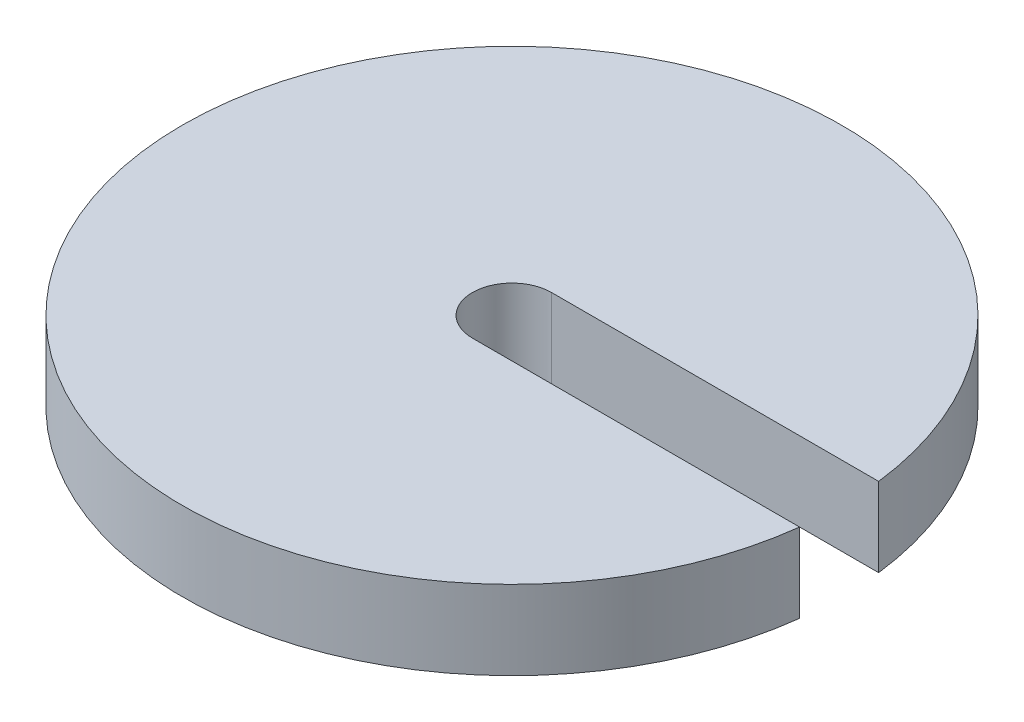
ISO-10303-21;
HEADER;
FILE_DESCRIPTION(('STEP AP214'),'2;1');
FILE_NAME('part.step','',(''),(''),'','','');
FILE_SCHEMA(('AUTOMOTIVE_DESIGN { 1 0 10303 214 1 1 1 1 }'));
ENDSEC;
DATA;
#1=APPLICATION_CONTEXT('core data for automotive mechanical design processes');
#2=APPLICATION_PROTOCOL_DEFINITION('international standard','automotive_design',2000,#1);
#3=PRODUCT_CONTEXT('',#1,'mechanical');
#4=PRODUCT('Part','Part','',(#3));
#5=PRODUCT_RELATED_PRODUCT_CATEGORY('part','',(#4));
#6=PRODUCT_DEFINITION_FORMATION('','',#4);
#7=PRODUCT_DEFINITION_CONTEXT('part definition',#1,'design');
#8=PRODUCT_DEFINITION('design','',#6,#7);
#9=PRODUCT_DEFINITION_SHAPE('','',#8);
#10=(LENGTH_UNIT() NAMED_UNIT(*) SI_UNIT(.MILLI.,.METRE.));
#11=(NAMED_UNIT(*) PLANE_ANGLE_UNIT() SI_UNIT($,.RADIAN.));
#12=(NAMED_UNIT(*) SI_UNIT($,.STERADIAN.) SOLID_ANGLE_UNIT());
#13=UNCERTAINTY_MEASURE_WITH_UNIT(LENGTH_MEASURE(1.E-05),#10,'distance_accuracy_value','');
#14=(GEOMETRIC_REPRESENTATION_CONTEXT(3) GLOBAL_UNCERTAINTY_ASSIGNED_CONTEXT((#13)) GLOBAL_UNIT_ASSIGNED_CONTEXT((#10,
#11,#12)) REPRESENTATION_CONTEXT('',''));
#15=CARTESIAN_POINT('',(0.,0.,0.));
#16=DIRECTION('',(0.,0.,1.));
#17=DIRECTION('',(1.,0.,0.));
#18=AXIS2_PLACEMENT_3D('',#15,#16,#17);
#19=CARTESIAN_POINT('',(-93.578018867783,-12.,84.528638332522));
#20=DIRECTION('',(0.,-1.,0.));
#21=DIRECTION('',(0.,0.,-1.));
#22=AXIS2_PLACEMENT_3D('',#19,#20,#21);
#23=PLANE('',#22);
#24=DIRECTION('',(-1.,0.,0.));
#25=VECTOR('',#24,1.);
#26=CARTESIAN_POINT('',(24.8193472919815,-11.9999999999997,6.));
#27=LINE('',#26,#25);
#28=CARTESIAN_POINT('',(49.6386945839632,-11.9999999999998,6.));
#29=VERTEX_POINT('',#28);
#30=CARTESIAN_POINT('',(0.,-11.9999999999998,6.));
#31=VERTEX_POINT('',#30);
#32=EDGE_CURVE('E66',#29,#31,#27,.T.);
#33=ORIENTED_EDGE('',*,*,#32,.F.);
#34=CARTESIAN_POINT('',(0.,-12.,0.));
#35=DIRECTION('',(0.,1.,0.));
#36=DIRECTION('',(0.,0.,1.));
#37=AXIS2_PLACEMENT_3D('',#34,#35,#36);
#38=CIRCLE('',#37,50.);
#39=CARTESIAN_POINT('',(49.6386945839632,-11.9999999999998,-6.));
#40=VERTEX_POINT('',#39);
#41=EDGE_CURVE('E20',#29,#40,#38,.F.);
#42=ORIENTED_EDGE('',*,*,#41,.T.);
#43=DIRECTION('',(1.,0.,0.));
#44=VECTOR('',#43,1.);
#45=CARTESIAN_POINT('',(24.8193472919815,-11.9999999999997,-6.));
#46=LINE('',#45,#44);
#47=CARTESIAN_POINT('',(0.,-11.9999999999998,-6.));
#48=VERTEX_POINT('',#47);
#49=EDGE_CURVE('E80',#48,#40,#46,.T.);
#50=ORIENTED_EDGE('',*,*,#49,.F.);
#51=CARTESIAN_POINT('',(0.,-12.,0.));
#52=DIRECTION('',(0.,-1.,0.));
#53=DIRECTION('',(0.,0.,-1.));
#54=AXIS2_PLACEMENT_3D('',#51,#52,#53);
#55=CIRCLE('',#54,6.);
#56=EDGE_CURVE('E67',#31,#48,#55,.T.);
#57=ORIENTED_EDGE('',*,*,#56,.F.);
#58=EDGE_LOOP('',(#33,#42,#50,#57));
#59=FACE_BOUND('',#58,.T.);
#60=ADVANCED_FACE('F16',(#59),#23,.T.);
#61=CARTESIAN_POINT('',(0.,-12.,0.));
#62=DIRECTION('',(0.,1.,0.));
#63=DIRECTION('',(0.,0.,1.));
#64=AXIS2_PLACEMENT_3D('',#61,#62,#63);
#65=CYLINDRICAL_SURFACE('',#64,50.);
#66=DIRECTION('',(0.,1.,0.));
#67=VECTOR('',#66,1.);
#68=CARTESIAN_POINT('',(49.638694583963,-24.8193472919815,-6.));
#69=LINE('',#68,#67);
#70=CARTESIAN_POINT('',(49.6386945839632,0.,-6.));
#71=VERTEX_POINT('',#70);
#72=EDGE_CURVE('E61',#40,#71,#69,.T.);
#73=ORIENTED_EDGE('',*,*,#72,.F.);
#74=ORIENTED_EDGE('',*,*,#41,.F.);
#75=DIRECTION('',(0.,-1.,0.));
#76=VECTOR('',#75,1.);
#77=CARTESIAN_POINT('',(49.638694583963,-24.8193472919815,6.));
#78=LINE('',#77,#76);
#79=CARTESIAN_POINT('',(49.6386945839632,0.,6.));
#80=VERTEX_POINT('',#79);
#81=EDGE_CURVE('E58',#80,#29,#78,.T.);
#82=ORIENTED_EDGE('',*,*,#81,.F.);
#83=CARTESIAN_POINT('',(0.,0.,0.));
#84=DIRECTION('',(0.,1.,0.));
#85=DIRECTION('',(0.,0.,1.));
#86=AXIS2_PLACEMENT_3D('',#83,#84,#85);
#87=CIRCLE('',#86,50.);
#88=EDGE_CURVE('E85',#71,#80,#87,.T.);
#89=ORIENTED_EDGE('',*,*,#88,.F.);
#90=EDGE_LOOP('',(#73,#74,#82,#89));
#91=FACE_BOUND('',#90,.T.);
#92=ADVANCED_FACE('F56',(#91),#65,.T.);
#93=CARTESIAN_POINT('',(49.638694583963,0.,6.));
#94=DIRECTION('',(0.,0.,-1.));
#95=DIRECTION('',(0.,-1.,0.));
#96=AXIS2_PLACEMENT_3D('',#93,#94,#95);
#97=PLANE('',#96);
#98=ORIENTED_EDGE('',*,*,#32,.T.);
#99=DIRECTION('',(0.,-1.,0.));
#100=VECTOR('',#99,1.);
#101=CARTESIAN_POINT('',(0.,-6.,6.));
#102=LINE('',#101,#100);
#103=CARTESIAN_POINT('',(0.,0.,6.));
#104=VERTEX_POINT('',#103);
#105=EDGE_CURVE('E70',#104,#31,#102,.T.);
#106=ORIENTED_EDGE('',*,*,#105,.F.);
#107=DIRECTION('',(-1.,0.,0.));
#108=VECTOR('',#107,1.);
#109=CARTESIAN_POINT('',(-21.7890094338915,0.,6.00000000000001));
#110=LINE('',#109,#108);
#111=EDGE_CURVE('E74',#80,#104,#110,.T.);
#112=ORIENTED_EDGE('',*,*,#111,.F.);
#113=ORIENTED_EDGE('',*,*,#81,.T.);
#114=EDGE_LOOP('',(#98,#106,#112,#113));
#115=FACE_BOUND('',#114,.T.);
#116=ADVANCED_FACE('F72',(#115),#97,.T.);
#117=CARTESIAN_POINT('',(0.,0.,0.));
#118=DIRECTION('',(0.,-1.,0.));
#119=DIRECTION('',(0.,0.,-1.));
#120=AXIS2_PLACEMENT_3D('',#117,#118,#119);
#121=CYLINDRICAL_SURFACE('',#120,6.);
#122=ORIENTED_EDGE('',*,*,#56,.T.);
#123=DIRECTION('',(0.,-1.,0.));
#124=VECTOR('',#123,1.);
#125=CARTESIAN_POINT('',(0.,-24.8193472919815,-6.));
#126=LINE('',#125,#124);
#127=CARTESIAN_POINT('',(0.,0.,-6.));
#128=VERTEX_POINT('',#127);
#129=EDGE_CURVE('E35',#128,#48,#126,.T.);
#130=ORIENTED_EDGE('',*,*,#129,.F.);
#131=CARTESIAN_POINT('',(0.,0.,0.));
#132=DIRECTION('',(0.,-1.,0.));
#133=DIRECTION('',(0.,0.,-1.));
#134=AXIS2_PLACEMENT_3D('',#131,#132,#133);
#135=CIRCLE('',#134,6.);
#136=EDGE_CURVE('E26',#104,#128,#135,.T.);
#137=ORIENTED_EDGE('',*,*,#136,.F.);
#138=ORIENTED_EDGE('',*,*,#105,.T.);
#139=EDGE_LOOP('',(#122,#130,#137,#138));
#140=FACE_BOUND('',#139,.T.);
#141=ADVANCED_FACE('F87',(#140),#121,.F.);
#142=CARTESIAN_POINT('',(0.,0.,-6.));
#143=DIRECTION('',(0.,0.,1.));
#144=DIRECTION('',(0.,-1.,0.));
#145=AXIS2_PLACEMENT_3D('',#142,#143,#144);
#146=PLANE('',#145);
#147=ORIENTED_EDGE('',*,*,#49,.T.);
#148=ORIENTED_EDGE('',*,*,#72,.T.);
#149=DIRECTION('',(1.,0.,0.));
#150=VECTOR('',#149,1.);
#151=CARTESIAN_POINT('',(-21.7890094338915,0.,-5.99999999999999));
#152=LINE('',#151,#150);
#153=EDGE_CURVE('E11',#128,#71,#152,.T.);
#154=ORIENTED_EDGE('',*,*,#153,.F.);
#155=ORIENTED_EDGE('',*,*,#129,.T.);
#156=EDGE_LOOP('',(#147,#148,#154,#155));
#157=FACE_BOUND('',#156,.T.);
#158=ADVANCED_FACE('F91',(#157),#146,.T.);
#159=CARTESIAN_POINT('',(-93.578018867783,0.,-84.528638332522));
#160=DIRECTION('',(0.,1.,0.));
#161=DIRECTION('',(0.,0.,1.));
#162=AXIS2_PLACEMENT_3D('',#159,#160,#161);
#163=PLANE('',#162);
#164=ORIENTED_EDGE('',*,*,#136,.T.);
#165=ORIENTED_EDGE('',*,*,#153,.T.);
#166=ORIENTED_EDGE('',*,*,#88,.T.);
#167=ORIENTED_EDGE('',*,*,#111,.T.);
#168=EDGE_LOOP('',(#164,#165,#166,#167));
#169=FACE_BOUND('',#168,.T.);
#170=ADVANCED_FACE('F18',(#169),#163,.T.);
#171=CLOSED_SHELL('',(#60,#92,#116,#141,#158,#170));
#172=MANIFOLD_SOLID_BREP('B1',#171);
#173=ADVANCED_BREP_SHAPE_REPRESENTATION('',(#18,#172),#14);
#174=SHAPE_DEFINITION_REPRESENTATION(#9,#173);
ENDSEC;
END-ISO-10303-21;
